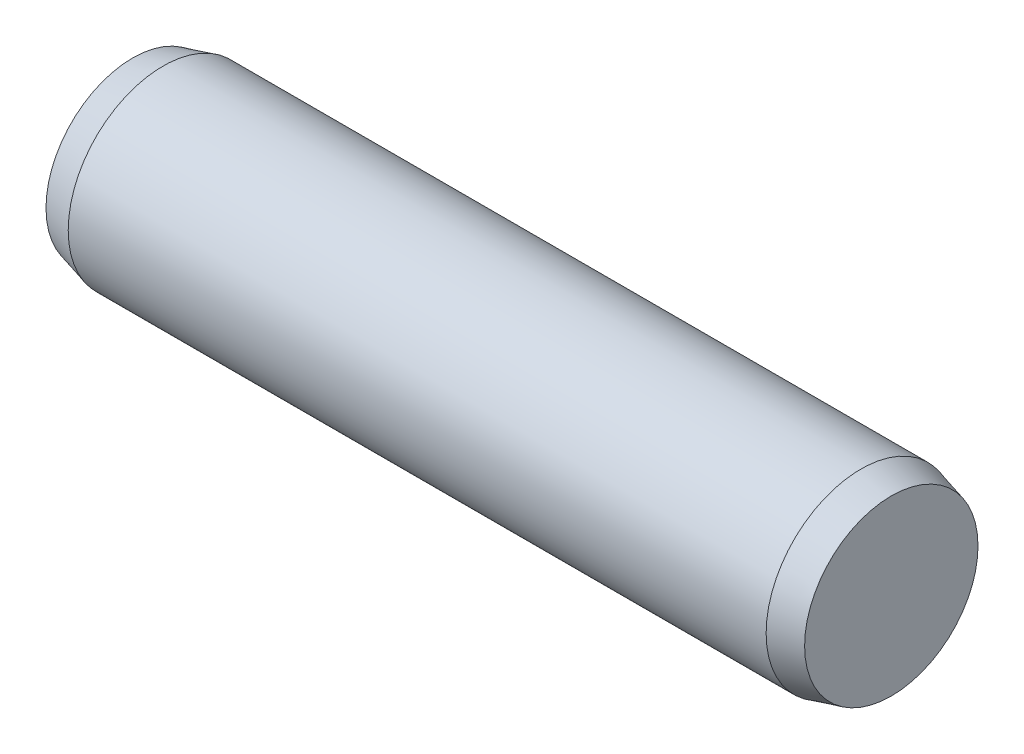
from build123d import *

# Parameters (mm, degrees)
EXTRUDE1_DEPTH      = 4.6
EXTRUDE1_DEPTH_BACK = 4.6
SKETCH2_R           = 1.25
SKETCH3_R           = 1.25
EXTRUDE2_DEPTH      = 0.4
EXTRUDE2_TAPER      = 15
SKETCH4_R           = 1.25
EXTRUDE3_DEPTH      = 0.4
EXTRUDE3_TAPER      = 15


with BuildPart() as part:
    # Sketch2 → Extrude1 (new, two sides: drawn at the far end of the back side and taken through both)
    with BuildSketch(Plane(origin=(0, 0, 0), x_dir=(0, 0, -1), z_dir=(1, 0, 0)).offset(-EXTRUDE1_DEPTH_BACK)):
        Circle(SKETCH2_R)
    extrude(amount=EXTRUDE1_DEPTH + EXTRUDE1_DEPTH_BACK)

    # Sketch3 → Extrude2 (add)
    with BuildSketch(Plane(origin=(4.6, 0, 0), x_dir=(0, 0, -1), z_dir=(1, 0, 0))):
        Circle(SKETCH3_R)
    extrude(amount=EXTRUDE2_DEPTH, taper=EXTRUDE2_TAPER)

    # Sketch4 → Extrude3 (add)
    with BuildSketch(Plane.ZY.offset(4.6)):
        with Locations(Location((0, 0, 0), (0, 0, 180))):
            Circle(SKETCH4_R)
    extrude(amount=EXTRUDE3_DEPTH, taper=EXTRUDE3_TAPER)


solid = part.part
